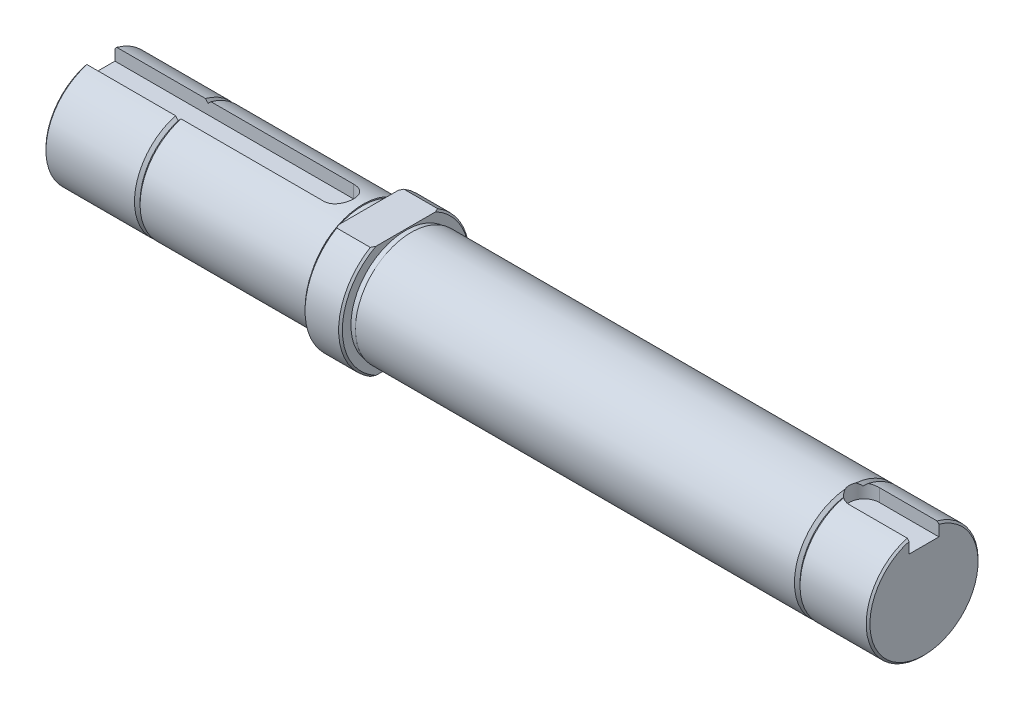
from build123d import *

# Parameters (mm, degrees)
CUT_EXTRUDE1_DEPTH = 4
CUT_EXTRUDE2_DEPTH = 4
CUT_EXTRUDE3_DEPTH = 10


with BuildPart() as part:
    # Sketch1 → Revolve1 (revolve)
    with BuildSketch(Plane.XY, mode=Mode.PRIVATE) as revolve1_sk:
        Polygon((0, 0), (0, 14.5), (0.5, 15), (70.5, 15), (70.5, 14.7), (72, 14.7), (72, 17), (72.5, 17.5), (81.5, 17.5), (82, 17), (82, 14.7), (83.5, 14.7), (83.5, 15), (220.5, 15), (221, 14.5), (221, 0), align=None)
    revolve(revolve1_sk.sketch.rotate(Axis((221, 0, 0), (-1, 0, 0)), 270), axis=Axis((221, 0, 0), (-1, 0, 0)))

    # Sketch2 → Cut-Extrude1 (cut)
    with BuildSketch(Plane(origin=(0, 15, 0), x_dir=(1, 0, 0), z_dir=(0, 1, 0))):
        with BuildLine():
            Line((0, -4), (64, -4))
            ThreePointArc((64, -4), (68, 0), (64, 4))
            Line((64, 4), (0, 4))
            Line((0, 4), (0, -4))
        make_face()
    extrude(amount=-CUT_EXTRUDE1_DEPTH, mode=Mode.SUBTRACT)

    # Sketch3 → Cut-Extrude2 (cut)
    with BuildSketch(Plane(origin=(0, 15, 0), x_dir=(1, 0, 0), z_dir=(0, 1, 0))):
        with BuildLine():
            Line((205, -4), (221, -4))
            Line((221, -4), (221, 4))
            Line((221, 4), (205, 4))
            ThreePointArc((205, 4), (201, 0), (205, -4))
        make_face()
    extrude(amount=-CUT_EXTRUDE2_DEPTH, mode=Mode.SUBTRACT)

    # Sketch4 → Cut-Extrude3 (cut)
    with BuildSketch(Plane(origin=(72, 0, 0), x_dir=(0, 0, -1), z_dir=(1, 0, 0))):
        Polygon((-70, 50), (-70, -50), (35, -50), (35, -15), (-35, -15), (-35, 15), (35, 15), (35, 50), align=None)
    extrude(amount=CUT_EXTRUDE3_DEPTH, mode=Mode.SUBTRACT)

    # Sketch5 → Cut-Revolve1 (revolve, cut)
    with BuildSketch(Plane.XY, mode=Mode.PRIVATE) as cut_revolve1_sk:
        Polygon((24.25, -15), (25, -14.25), (25.75, -15), align=None)
        Polygon((201.25, -15), (202, -14.25), (202.75, -15), align=None)
    revolve(cut_revolve1_sk.sketch.rotate(Axis((0, 0, 0), (1, 0, 0)), 270), axis=Axis((0, 0, 0), (1, 0, 0)), mode=Mode.SUBTRACT)


solid = part.part
